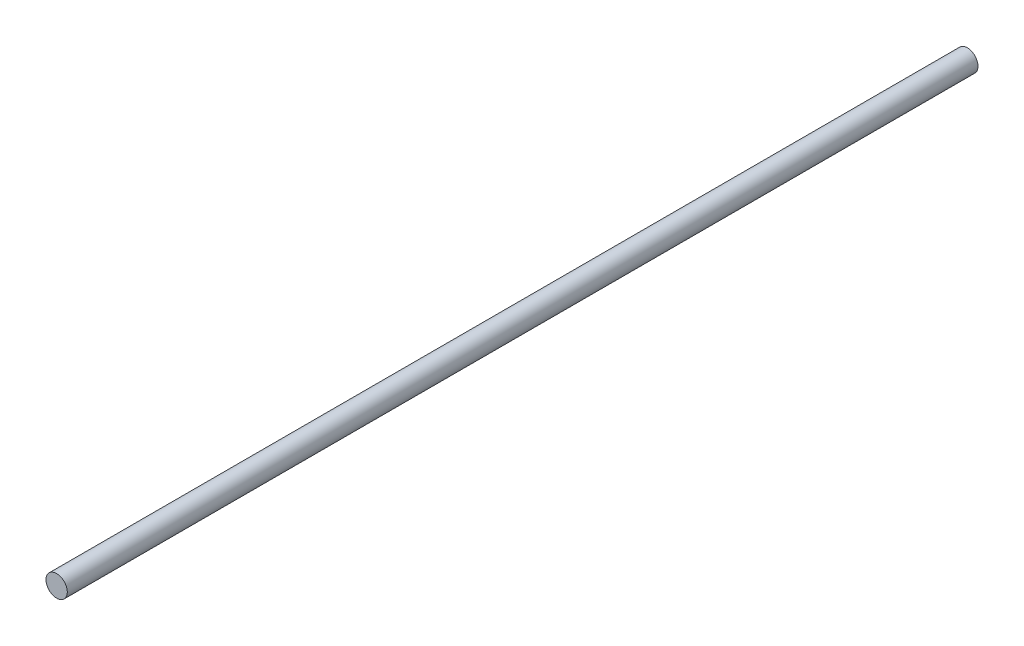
from build123d import *

# Parameters (mm, degrees)
SKETCH1_R           = 2.0828
BOSS_EXTRUDE1_DEPTH = 88.9


with BuildPart() as part:
    # Sketch1 → Boss-Extrude1 (new, symmetric)
    with BuildSketch(Plane.XY):
        Circle(SKETCH1_R)
    extrude(amount=BOSS_EXTRUDE1_DEPTH, both=True)


solid = part.part
